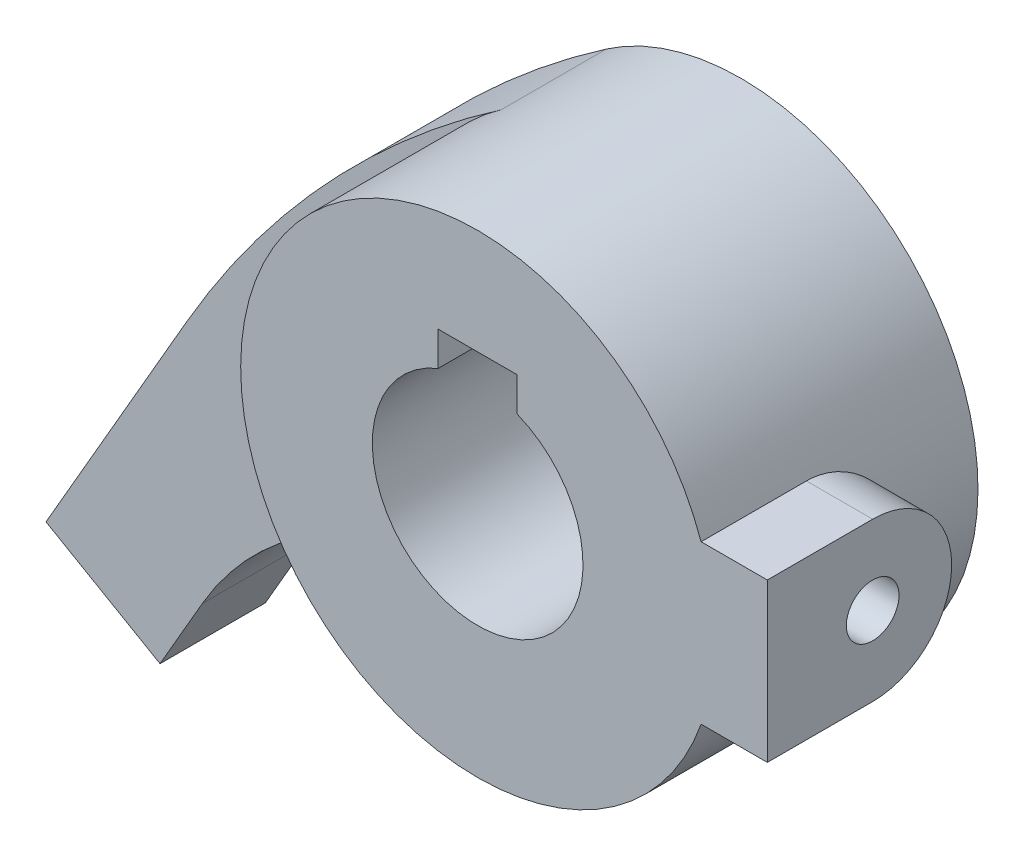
ISO-10303-21;
HEADER;
FILE_DESCRIPTION(('STEP AP214'),'2;1');
FILE_NAME('part.step','',(''),(''),'','','');
FILE_SCHEMA(('AUTOMOTIVE_DESIGN { 1 0 10303 214 1 1 1 1 }'));
ENDSEC;
DATA;
#1=APPLICATION_CONTEXT('core data for automotive mechanical design processes');
#2=APPLICATION_PROTOCOL_DEFINITION('international standard','automotive_design',2000,#1);
#3=PRODUCT_CONTEXT('',#1,'mechanical');
#4=PRODUCT('Part','Part','',(#3));
#5=PRODUCT_RELATED_PRODUCT_CATEGORY('part','',(#4));
#6=PRODUCT_DEFINITION_FORMATION('','',#4);
#7=PRODUCT_DEFINITION_CONTEXT('part definition',#1,'design');
#8=PRODUCT_DEFINITION('design','',#6,#7);
#9=PRODUCT_DEFINITION_SHAPE('','',#8);
#10=(LENGTH_UNIT() NAMED_UNIT(*) SI_UNIT(.MILLI.,.METRE.));
#11=(NAMED_UNIT(*) PLANE_ANGLE_UNIT() SI_UNIT($,.RADIAN.));
#12=(NAMED_UNIT(*) SI_UNIT($,.STERADIAN.) SOLID_ANGLE_UNIT());
#13=UNCERTAINTY_MEASURE_WITH_UNIT(LENGTH_MEASURE(1.E-05),#10,'distance_accuracy_value','');
#14=(GEOMETRIC_REPRESENTATION_CONTEXT(3) GLOBAL_UNCERTAINTY_ASSIGNED_CONTEXT((#13)) GLOBAL_UNIT_ASSIGNED_CONTEXT((#10,
#11,#12)) REPRESENTATION_CONTEXT('',''));
#15=CARTESIAN_POINT('',(0.,0.,0.));
#16=DIRECTION('',(0.,0.,1.));
#17=DIRECTION('',(1.,0.,0.));
#18=AXIS2_PLACEMENT_3D('',#15,#16,#17);
#19=CARTESIAN_POINT('',(0.,0.,20.));
#20=DIRECTION('',(0.,0.,-1.));
#21=DIRECTION('',(-1.,0.,0.));
#22=AXIS2_PLACEMENT_3D('',#19,#20,#21);
#23=CYLINDRICAL_SURFACE('',#22,18.);
#24=CARTESIAN_POINT('',(0.,0.,20.));
#25=DIRECTION('',(0.,0.,1.));
#26=DIRECTION('',(1.,0.,0.));
#27=AXIS2_PLACEMENT_3D('',#24,#25,#26);
#28=CIRCLE('',#27,18.);
#29=CARTESIAN_POINT('',(16.9705627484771,6.,20.));
#30=VERTEX_POINT('',#29);
#31=CARTESIAN_POINT('',(16.9705627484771,-6.,20.));
#32=VERTEX_POINT('',#31);
#33=EDGE_CURVE('E11',#30,#32,#28,.T.);
#34=ORIENTED_EDGE('',*,*,#33,.F.);
#35=DIRECTION('',(0.,0.,-1.));
#36=VECTOR('',#35,1.);
#37=CARTESIAN_POINT('',(16.9705627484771,6.,20.));
#38=LINE('',#37,#36);
#39=CARTESIAN_POINT('',(16.9705627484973,6.,12.));
#40=VERTEX_POINT('',#39);
#41=EDGE_CURVE('E153',#40,#30,#38,.F.);
#42=ORIENTED_EDGE('',*,*,#41,.F.);
#43=CARTESIAN_POINT('',(16.9705627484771,-6.,12.));
#44=CARTESIAN_POINT('',(16.9705358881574,-6.00002327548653,11.8363059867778));
#45=CARTESIAN_POINT('',(16.9729302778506,-5.99330214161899,11.6726221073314));
#46=CARTESIAN_POINT('',(16.9823649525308,-5.96654425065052,11.3465240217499));
#47=CARTESIAN_POINT('',(16.9894039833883,-5.94651108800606,11.1841094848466));
#48=CARTESIAN_POINT('',(17.0079041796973,-5.89338071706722,10.8621857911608));
#49=CARTESIAN_POINT('',(17.0193522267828,-5.86032225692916,10.7026694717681));
#50=CARTESIAN_POINT('',(17.0463054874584,-5.78145443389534,10.3871697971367));
#51=CARTESIAN_POINT('',(17.0618108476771,-5.73564461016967,10.231186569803));
#52=CARTESIAN_POINT('',(17.096396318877,-5.63171582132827,9.92393152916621));
#53=CARTESIAN_POINT('',(17.1154735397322,-5.57360680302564,9.77265602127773));
#54=CARTESIAN_POINT('',(17.1566605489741,-5.44550500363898,9.47558904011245));
#55=CARTESIAN_POINT('',(17.1787714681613,-5.37550778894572,9.32979963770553));
#56=CARTESIAN_POINT('',(17.2254031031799,-5.22415126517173,9.04461346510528));
#57=CARTESIAN_POINT('',(17.2499242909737,-5.14278972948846,8.90521795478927));
#58=CARTESIAN_POINT('',(17.3007173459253,-4.9692408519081,8.63360277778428));
#59=CARTESIAN_POINT('',(17.326989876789,-4.8770493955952,8.50138586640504));
#60=CARTESIAN_POINT('',(17.3815260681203,-4.67904463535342,8.24043953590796));
#61=CARTESIAN_POINT('',(17.4098272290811,-4.57286774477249,8.11199371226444));
#62=CARTESIAN_POINT('',(17.4667935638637,-4.35021031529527,7.86437382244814));
#63=CARTESIAN_POINT('',(17.49545886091,-4.23372620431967,7.74520299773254));
#64=CARTESIAN_POINT('',(17.5523750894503,-3.99119540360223,7.51691026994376));
#65=CARTESIAN_POINT('',(17.5806260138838,-3.86514855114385,7.40778853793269));
#66=CARTESIAN_POINT('',(17.6359611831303,-3.60425478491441,7.20029931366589));
#67=CARTESIAN_POINT('',(17.6630454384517,-3.46940795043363,7.1019317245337));
#68=CARTESIAN_POINT('',(17.716017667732,-3.1880620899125,6.91417565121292));
#69=CARTESIAN_POINT('',(17.7418552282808,-3.04134950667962,6.82509253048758));
#70=CARTESIAN_POINT('',(17.790803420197,-2.74053335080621,6.65968846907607));
#71=CARTESIAN_POINT('',(17.8139150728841,-2.5864325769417,6.58336274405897));
#72=CARTESIAN_POINT('',(17.8567641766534,-2.27182245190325,6.44406426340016));
#73=CARTESIAN_POINT('',(17.8765010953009,-2.11131209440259,6.38109361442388));
#74=CARTESIAN_POINT('',(17.9120119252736,-1.78513959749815,6.26911941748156));
#75=CARTESIAN_POINT('',(17.9277876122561,-1.61947980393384,6.22010961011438));
#76=CARTESIAN_POINT('',(17.9544516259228,-1.28997729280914,6.13793631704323));
#77=CARTESIAN_POINT('',(17.9654893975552,-1.12626807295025,6.10428575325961));
#78=CARTESIAN_POINT('',(17.9831292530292,-0.796442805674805,6.05074979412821));
#79=CARTESIAN_POINT('',(17.9897331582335,-0.630327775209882,6.03085874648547));
#80=CARTESIAN_POINT('',(17.9983239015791,-0.296898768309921,6.00501776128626));
#81=CARTESIAN_POINT('',(18.0003107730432,-0.129584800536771,5.99906772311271));
#82=CARTESIAN_POINT('',(17.999610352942,0.204943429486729,6.00116890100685));
#83=CARTESIAN_POINT('',(17.9969231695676,0.372157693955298,6.00921979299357));
#84=CARTESIAN_POINT('',(17.987149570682,0.698613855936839,6.038646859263));
#85=CARTESIAN_POINT('',(17.9802409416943,0.857909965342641,6.05948465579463));
#86=CARTESIAN_POINT('',(17.9623622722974,1.17415159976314,6.1138198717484));
#87=CARTESIAN_POINT('',(17.9513908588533,1.33109631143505,6.14732157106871));
#88=CARTESIAN_POINT('',(17.9256761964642,1.64145470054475,6.22667565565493));
#89=CARTESIAN_POINT('',(17.9109342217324,1.79486955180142,6.27252386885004));
#90=CARTESIAN_POINT('',(17.8780472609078,2.09727695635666,6.37621207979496));
#91=CARTESIAN_POINT('',(17.8599009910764,2.24626781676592,6.4340566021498));
#92=CARTESIAN_POINT('',(17.8204139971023,2.54070679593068,6.56208597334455));
#93=CARTESIAN_POINT('',(17.7990354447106,2.686085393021,6.632418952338));
#94=CARTESIAN_POINT('',(17.753792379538,2.97045362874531,6.78440731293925));
#95=CARTESIAN_POINT('',(17.7299270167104,3.10944105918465,6.86606656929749));
#96=CARTESIAN_POINT('',(17.6803107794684,3.38017058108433,7.04012638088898));
#97=CARTESIAN_POINT('',(17.6545598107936,3.51191230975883,7.13252747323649));
#98=CARTESIAN_POINT('',(17.601809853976,3.767400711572,7.32747242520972));
#99=CARTESIAN_POINT('',(17.5748108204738,3.89114709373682,7.43001665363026));
#100=CARTESIAN_POINT('',(17.5189422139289,4.13559143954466,7.64969602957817));
#101=CARTESIAN_POINT('',(17.4900445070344,4.2558696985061,7.76729146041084));
#102=CARTESIAN_POINT('',(17.4324086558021,4.4861132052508,8.01214074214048));
#103=CARTESIAN_POINT('',(17.4036704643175,4.59608167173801,8.13939155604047));
#104=CARTESIAN_POINT('',(17.3471202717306,4.8051173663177,8.40289722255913));
#105=CARTESIAN_POINT('',(17.3193089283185,4.90417696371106,8.53915827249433));
#106=CARTESIAN_POINT('',(17.2654357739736,5.09059336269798,8.81971485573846));
#107=CARTESIAN_POINT('',(17.239373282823,5.17795472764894,8.96400722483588));
#108=CARTESIAN_POINT('',(17.1893738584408,5.34161618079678,9.26203101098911));
#109=CARTESIAN_POINT('',(17.1654753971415,5.41772728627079,9.41587280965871));
#110=CARTESIAN_POINT('',(17.1210224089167,5.556609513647,9.72985774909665));
#111=CARTESIAN_POINT('',(17.1004664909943,5.61938618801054,9.88999823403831));
#112=CARTESIAN_POINT('',(17.0633817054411,5.73100924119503,10.2153228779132));
#113=CARTESIAN_POINT('',(17.0468484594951,5.77987077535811,10.3805013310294));
#114=CARTESIAN_POINT('',(17.0183470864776,5.86325820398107,10.7147529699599));
#115=CARTESIAN_POINT('',(17.0063768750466,5.89779064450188,10.883824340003));
#116=CARTESIAN_POINT('',(16.9882040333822,5.94992929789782,11.2104634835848));
#117=CARTESIAN_POINT('',(16.9816058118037,5.96870055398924,11.3678241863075));
#118=CARTESIAN_POINT('',(16.9727764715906,5.99373749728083,11.6834525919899));
#119=CARTESIAN_POINT('',(16.9705397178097,6.00001932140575,11.8417188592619));
#120=CARTESIAN_POINT('',(16.9705627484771,6.,12.));
#121=B_SPLINE_CURVE_WITH_KNOTS('',3,(#43,#44,#45,#46,#47,#48,#49,#50,#51,#52,#53,#54,#55,#56,
#57,#58,#59,#60,#61,#62,#63,#64,#65,#66,#67,#68,#69,#70,#71,#72,#73,#74,#75,#76,#77,#78,#79,#80,
#81,#82,#83,#84,#85,#86,#87,#88,#89,#90,#91,#92,#93,#94,#95,#96,#97,#98,#99,#100,#101,#102,#103,
#104,#105,#106,#107,#108,#109,#110,#111,#112,#113,#114,#115,#116,#117,#118,#119,#120),
.UNSPECIFIED.,.F.,.F.,(4,2,2,2,2,2,2,2,2,2,2,2,2,2,2,2,2,2,2,2,2,2,2,2,2,2,2,2,2,2,2,2,2,2,2,2,
2,2,4),(0.,0.490910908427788,0.9816893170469,1.47101863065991,1.96036563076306,2.44931837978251,
2.93845388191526,3.42768535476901,3.91710329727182,4.42363425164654,4.93034144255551,
5.43705725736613,5.94376850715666,6.46384823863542,6.98373248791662,7.50369868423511,
8.02343138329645,8.52528690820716,9.02693615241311,9.52858177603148,10.0302157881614,
10.5120543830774,10.9940559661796,11.4758948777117,11.9579158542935,12.4460912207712,
12.9344340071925,13.4228012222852,13.9111862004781,14.4226273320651,14.9339082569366,
15.445544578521,15.9569807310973,16.4762155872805,16.9952338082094,17.5136845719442,
18.0318982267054,18.5071898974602,18.9818670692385),.UNSPECIFIED.);
#122=CARTESIAN_POINT('',(16.9705627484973,-6.,12.));
#123=VERTEX_POINT('',#122);
#124=EDGE_CURVE('E151',#123,#40,#121,.T.);
#125=ORIENTED_EDGE('',*,*,#124,.F.);
#126=DIRECTION('',(0.,0.,-1.));
#127=VECTOR('',#126,1.);
#128=CARTESIAN_POINT('',(16.9705627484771,-6.,20.));
#129=LINE('',#128,#127);
#130=EDGE_CURVE('E159',#32,#123,#129,.T.);
#131=ORIENTED_EDGE('',*,*,#130,.F.);
#132=EDGE_LOOP('',(#34,#42,#125,#131));
#133=FACE_BOUND('',#132,.T.);
#134=DIRECTION('',(0.,0.,-1.));
#135=VECTOR('',#134,1.);
#136=CARTESIAN_POINT('',(-10.2174061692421,14.819062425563,8.));
#137=LINE('',#136,#135);
#138=CARTESIAN_POINT('',(-10.2174061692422,14.819062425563,8.));
#139=VERTEX_POINT('',#138);
#140=CARTESIAN_POINT('',(-10.2174061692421,14.819062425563,0.));
#141=VERTEX_POINT('',#140);
#142=EDGE_CURVE('E50',#139,#141,#137,.T.);
#143=ORIENTED_EDGE('',*,*,#142,.F.);
#144=CARTESIAN_POINT('',(0.,0.,8.));
#145=DIRECTION('',(0.,0.,-1.));
#146=DIRECTION('',(1.,0.,0.));
#147=AXIS2_PLACEMENT_3D('',#144,#145,#146);
#148=CIRCLE('',#147,18.);
#149=CARTESIAN_POINT('',(-4.7127894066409,-17.3720930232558,8.));
#150=VERTEX_POINT('',#149);
#151=EDGE_CURVE('E45',#150,#139,#148,.T.);
#152=ORIENTED_EDGE('',*,*,#151,.F.);
#153=DIRECTION('',(0.,0.,-1.));
#154=VECTOR('',#153,1.);
#155=CARTESIAN_POINT('',(-4.7127894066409,-17.3720930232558,8.));
#156=LINE('',#155,#154);
#157=CARTESIAN_POINT('',(-4.7127894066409,-17.3720930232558,0.));
#158=VERTEX_POINT('',#157);
#159=EDGE_CURVE('E254',#150,#158,#156,.T.);
#160=ORIENTED_EDGE('',*,*,#159,.T.);
#161=CARTESIAN_POINT('',(0.,0.,0.));
#162=DIRECTION('',(0.,0.,1.));
#163=DIRECTION('',(1.,0.,0.));
#164=AXIS2_PLACEMENT_3D('',#161,#162,#163);
#165=CIRCLE('',#164,18.);
#166=EDGE_CURVE('E34',#158,#141,#165,.T.);
#167=ORIENTED_EDGE('',*,*,#166,.T.);
#168=EDGE_LOOP('',(#143,#152,#160,#167));
#169=FACE_BOUND('',#168,.T.);
#170=ADVANCED_FACE('F31',(#133,#169),#23,.T.);
#171=CARTESIAN_POINT('',(0.,0.,20.));
#172=DIRECTION('',(0.,0.,1.));
#173=DIRECTION('',(1.,0.,0.));
#174=AXIS2_PLACEMENT_3D('',#171,#172,#173);
#175=PLANE('',#174);
#176=ORIENTED_EDGE('',*,*,#33,.T.);
#177=DIRECTION('',(1.,0.,0.));
#178=VECTOR('',#177,1.);
#179=CARTESIAN_POINT('',(-500000.,-6.,20.));
#180=LINE('',#179,#178);
#181=CARTESIAN_POINT('',(22.,-6.,20.));
#182=VERTEX_POINT('',#181);
#183=EDGE_CURVE('E206',#32,#182,#180,.T.);
#184=ORIENTED_EDGE('',*,*,#183,.T.);
#185=DIRECTION('',(0.,-1.,0.));
#186=VECTOR('',#185,1.);
#187=CARTESIAN_POINT('',(22.,6.,20.));
#188=LINE('',#187,#186);
#189=CARTESIAN_POINT('',(22.,6.,20.));
#190=VERTEX_POINT('',#189);
#191=EDGE_CURVE('E210',#190,#182,#188,.T.);
#192=ORIENTED_EDGE('',*,*,#191,.F.);
#193=DIRECTION('',(1.,0.,0.));
#194=VECTOR('',#193,1.);
#195=CARTESIAN_POINT('',(-500000.,6.,20.));
#196=LINE('',#195,#194);
#197=EDGE_CURVE('E208',#30,#190,#196,.T.);
#198=ORIENTED_EDGE('',*,*,#197,.F.);
#199=EDGE_LOOP('',(#176,#184,#192,#198));
#200=FACE_BOUND('',#199,.T.);
#201=DIRECTION('',(0.,1.,0.));
#202=VECTOR('',#201,1.);
#203=CARTESIAN_POINT('',(3.,7.41619848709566,20.));
#204=LINE('',#203,#202);
#205=CARTESIAN_POINT('',(3.,7.41619848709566,20.));
#206=VERTEX_POINT('',#205);
#207=CARTESIAN_POINT('',(3.,10.,20.));
#208=VERTEX_POINT('',#207);
#209=EDGE_CURVE('E222',#206,#208,#204,.T.);
#210=ORIENTED_EDGE('',*,*,#209,.F.);
#211=CARTESIAN_POINT('',(0.,0.,20.));
#212=DIRECTION('',(0.,0.,1.));
#213=DIRECTION('',(1.,0.,0.));
#214=AXIS2_PLACEMENT_3D('',#211,#212,#213);
#215=CIRCLE('',#214,8.);
#216=CARTESIAN_POINT('',(-3.,7.41619848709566,20.));
#217=VERTEX_POINT('',#216);
#218=EDGE_CURVE('E220',#217,#206,#215,.T.);
#219=ORIENTED_EDGE('',*,*,#218,.F.);
#220=DIRECTION('',(0.,-1.,0.));
#221=VECTOR('',#220,1.);
#222=CARTESIAN_POINT('',(-3.,7.41619848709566,20.));
#223=LINE('',#222,#221);
#224=CARTESIAN_POINT('',(-3.,10.,20.));
#225=VERTEX_POINT('',#224);
#226=EDGE_CURVE('E228',#225,#217,#223,.T.);
#227=ORIENTED_EDGE('',*,*,#226,.F.);
#228=DIRECTION('',(-1.,0.,0.));
#229=VECTOR('',#228,1.);
#230=CARTESIAN_POINT('',(-3.,10.,20.));
#231=LINE('',#230,#229);
#232=EDGE_CURVE('E225',#208,#225,#231,.T.);
#233=ORIENTED_EDGE('',*,*,#232,.F.);
#234=EDGE_LOOP('',(#210,#219,#227,#233));
#235=FACE_BOUND('',#234,.T.);
#236=ADVANCED_FACE('F191',(#200,#235),#175,.T.);
#237=CARTESIAN_POINT('',(0.,0.,0.));
#238=DIRECTION('',(0.,0.,1.));
#239=DIRECTION('',(1.,0.,0.));
#240=AXIS2_PLACEMENT_3D('',#237,#238,#239);
#241=PLANE('',#240);
#242=ORIENTED_EDGE('',*,*,#166,.F.);
#243=CARTESIAN_POINT('',(-11.2583302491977,-41.5,0.));
#244=DIRECTION('',(0.,0.,-1.));
#245=DIRECTION('',(1.,0.,0.));
#246=AXIS2_PLACEMENT_3D('',#243,#244,#245);
#247=CIRCLE('',#246,25.);
#248=CARTESIAN_POINT('',(-32.9089653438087,-29.,0.));
#249=VERTEX_POINT('',#248);
#250=EDGE_CURVE('E146',#249,#158,#247,.T.);
#251=ORIENTED_EDGE('',*,*,#250,.F.);
#252=DIRECTION('',(0.499999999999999,0.866025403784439,0.));
#253=VECTOR('',#252,1.);
#254=CARTESIAN_POINT('',(-32.9089653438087,-29.,0.));
#255=LINE('',#254,#253);
#256=CARTESIAN_POINT('',(-36.1243556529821,-34.5692193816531,0.));
#257=VERTEX_POINT('',#256);
#258=EDGE_CURVE('E273',#257,#249,#255,.T.);
#259=ORIENTED_EDGE('',*,*,#258,.F.);
#260=DIRECTION('',(0.866025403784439,-0.499999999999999,0.));
#261=VECTOR('',#260,1.);
#262=CARTESIAN_POINT('',(-44.7846096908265,-29.5692193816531,0.));
#263=LINE('',#262,#261);
#264=CARTESIAN_POINT('',(-44.7846096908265,-29.5692193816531,0.));
#265=VERTEX_POINT('',#264);
#266=EDGE_CURVE('E264',#265,#257,#263,.T.);
#267=ORIENTED_EDGE('',*,*,#266,.F.);
#268=DIRECTION('',(-0.5,-0.866025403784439,0.));
#269=VECTOR('',#268,1.);
#270=CARTESIAN_POINT('',(-34.0887443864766,-11.0434372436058,0.));
#271=LINE('',#270,#269);
#272=CARTESIAN_POINT('',(-34.0887443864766,-11.0434372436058,0.));
#273=VERTEX_POINT('',#272);
#274=EDGE_CURVE('E261',#273,#265,#271,.T.);
#275=ORIENTED_EDGE('',*,*,#274,.F.);
#276=CARTESIAN_POINT('',(35.1932879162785,-51.0434372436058,0.));
#277=DIRECTION('',(0.,0.,1.));
#278=DIRECTION('',(1.,0.,0.));
#279=AXIS2_PLACEMENT_3D('',#276,#277,#278);
#280=CIRCLE('',#279,80.);
#281=EDGE_CURVE('E150',#141,#273,#280,.T.);
#282=ORIENTED_EDGE('',*,*,#281,.F.);
#283=EDGE_LOOP('',(#242,#251,#259,#267,#275,#282));
#284=FACE_BOUND('',#283,.T.);
#285=CARTESIAN_POINT('',(0.,0.,0.));
#286=DIRECTION('',(0.,0.,1.));
#287=DIRECTION('',(1.,0.,0.));
#288=AXIS2_PLACEMENT_3D('',#285,#286,#287);
#289=CIRCLE('',#288,8.);
#290=CARTESIAN_POINT('',(-3.,7.41619848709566,0.));
#291=VERTEX_POINT('',#290);
#292=CARTESIAN_POINT('',(3.,7.41619848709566,0.));
#293=VERTEX_POINT('',#292);
#294=EDGE_CURVE('E231',#291,#293,#289,.T.);
#295=ORIENTED_EDGE('',*,*,#294,.T.);
#296=DIRECTION('',(0.,1.,0.));
#297=VECTOR('',#296,1.);
#298=CARTESIAN_POINT('',(3.,7.41619848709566,0.));
#299=LINE('',#298,#297);
#300=CARTESIAN_POINT('',(3.,10.,0.));
#301=VERTEX_POINT('',#300);
#302=EDGE_CURVE('E234',#293,#301,#299,.T.);
#303=ORIENTED_EDGE('',*,*,#302,.T.);
#304=DIRECTION('',(-1.,0.,0.));
#305=VECTOR('',#304,1.);
#306=CARTESIAN_POINT('',(-3.,10.,0.));
#307=LINE('',#306,#305);
#308=CARTESIAN_POINT('',(-3.,10.,0.));
#309=VERTEX_POINT('',#308);
#310=EDGE_CURVE('E238',#301,#309,#307,.T.);
#311=ORIENTED_EDGE('',*,*,#310,.T.);
#312=DIRECTION('',(0.,-1.,0.));
#313=VECTOR('',#312,1.);
#314=CARTESIAN_POINT('',(-3.,7.41619848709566,0.));
#315=LINE('',#314,#313);
#316=EDGE_CURVE('E223',#309,#291,#315,.T.);
#317=ORIENTED_EDGE('',*,*,#316,.T.);
#318=EDGE_LOOP('',(#295,#303,#311,#317));
#319=FACE_BOUND('',#318,.T.);
#320=ADVANCED_FACE('F196',(#284,#319),#241,.F.);
#321=CARTESIAN_POINT('',(0.,0.,20.));
#322=DIRECTION('',(0.,0.,-1.));
#323=DIRECTION('',(-1.,0.,0.));
#324=AXIS2_PLACEMENT_3D('',#321,#322,#323);
#325=CYLINDRICAL_SURFACE('',#324,8.);
#326=CARTESIAN_POINT('',(8.,0.,10.));
#327=CARTESIAN_POINT('',(7.9999981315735,-0.110501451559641,10.0000031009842));
#328=CARTESIAN_POINT('',(7.99768770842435,-0.221037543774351,10.0091887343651));
#329=CARTESIAN_POINT('',(7.98869485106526,-0.438941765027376,10.045633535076));
#330=CARTESIAN_POINT('',(7.98200993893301,-0.546308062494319,10.0729029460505));
#331=CARTESIAN_POINT('',(7.96500835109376,-0.754694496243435,10.1445856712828));
#332=CARTESIAN_POINT('',(7.95469603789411,-0.855722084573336,10.188978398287));
#333=CARTESIAN_POINT('',(7.93153791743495,-1.04889617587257,10.2935751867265));
#334=CARTESIAN_POINT('',(7.91869202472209,-1.14104237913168,10.353779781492));
#335=CARTESIAN_POINT('',(7.89156551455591,-1.31573590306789,10.4896010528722));
#336=CARTESIAN_POINT('',(7.87726276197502,-1.39807425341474,10.5654820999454));
#337=CARTESIAN_POINT('',(7.84898160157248,-1.54899856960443,10.729936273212));
#338=CARTESIAN_POINT('',(7.83500323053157,-1.61758298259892,10.8185108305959));
#339=CARTESIAN_POINT('',(7.80873034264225,-1.74003539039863,11.007460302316));
#340=CARTESIAN_POINT('',(7.79646392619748,-1.79366962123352,11.1079909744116));
#341=CARTESIAN_POINT('',(7.77532659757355,-1.88319587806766,11.3169978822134));
#342=CARTESIAN_POINT('',(7.76645514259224,-1.91909074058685,11.4254728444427));
#343=CARTESIAN_POINT('',(7.7533396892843,-1.97140644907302,11.6449913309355));
#344=CARTESIAN_POINT('',(7.74900654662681,-1.98820302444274,11.755939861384));
#345=CARTESIAN_POINT('',(7.74519149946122,-2.00301570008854,11.9791580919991));
#346=CARTESIAN_POINT('',(7.74570880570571,-2.00103485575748,12.0914275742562));
#347=CARTESIAN_POINT('',(7.75145607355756,-1.97864869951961,12.3112210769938));
#348=CARTESIAN_POINT('',(7.75657150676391,-1.95869112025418,12.4187941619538));
#349=CARTESIAN_POINT('',(7.77075612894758,-1.90163224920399,12.6290147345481));
#350=CARTESIAN_POINT('',(7.77982559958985,-1.86452973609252,12.7316618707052));
#351=CARTESIAN_POINT('',(7.80100151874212,-1.77385263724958,12.9303173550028));
#352=CARTESIAN_POINT('',(7.81313769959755,-1.72011555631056,13.0262482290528));
#353=CARTESIAN_POINT('',(7.83906281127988,-1.59780836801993,13.2078916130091));
#354=CARTESIAN_POINT('',(7.85285203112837,-1.52923566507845,13.2936023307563));
#355=CARTESIAN_POINT('',(7.88101174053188,-1.37688456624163,13.4549381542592));
#356=CARTESIAN_POINT('',(7.89538759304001,-1.29272834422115,13.5302059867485));
#357=CARTESIAN_POINT('',(7.92274620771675,-1.11281589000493,13.6656283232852));
#358=CARTESIAN_POINT('',(7.93572892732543,-1.01705930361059,13.7257823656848));
#359=CARTESIAN_POINT('',(7.9589030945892,-0.816154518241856,13.8294007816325));
#360=CARTESIAN_POINT('',(7.96908480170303,-0.710975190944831,13.8728071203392));
#361=CARTESIAN_POINT('',(7.98543889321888,-0.49450134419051,13.9412230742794));
#362=CARTESIAN_POINT('',(7.99161204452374,-0.383207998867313,13.9662362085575));
#363=CARTESIAN_POINT('',(7.999139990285,-0.160719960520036,13.9966100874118));
#364=CARTESIAN_POINT('',(8.00061404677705,-0.0495956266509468,14.0024573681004));
#365=CARTESIAN_POINT('',(7.99891739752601,0.172043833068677,13.9956679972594));
#366=CARTESIAN_POINT('',(7.99574710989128,0.282559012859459,13.9830330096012));
#367=CARTESIAN_POINT('',(7.98519441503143,0.498152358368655,13.9400387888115));
#368=CARTESIAN_POINT('',(7.97787512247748,0.603286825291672,13.9099449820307));
#369=CARTESIAN_POINT('',(7.95984942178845,0.807009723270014,13.8331905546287));
#370=CARTESIAN_POINT('',(7.94914267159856,0.905597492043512,13.7865282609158));
#371=CARTESIAN_POINT('',(7.92524410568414,1.0953641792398,13.6770184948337));
#372=CARTESIAN_POINT('',(7.91201156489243,1.18638058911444,13.6138985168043));
#373=CARTESIAN_POINT('',(7.88459345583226,1.35670215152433,13.4736134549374));
#374=CARTESIAN_POINT('',(7.87040772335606,1.43600527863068,13.3964459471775));
#375=CARTESIAN_POINT('',(7.84225275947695,1.58265409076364,13.2279973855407));
#376=CARTESIAN_POINT('',(7.82829738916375,1.64965849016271,13.1364163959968));
#377=CARTESIAN_POINT('',(7.80257171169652,1.7673476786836,12.9430231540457));
#378=CARTESIAN_POINT('',(7.79080130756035,1.81803319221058,12.8412113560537));
#379=CARTESIAN_POINT('',(7.77090792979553,1.90126856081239,12.6307923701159));
#380=CARTESIAN_POINT('',(7.76276340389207,1.93392586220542,12.5222298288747));
#381=CARTESIAN_POINT('',(7.75102325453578,1.98046087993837,12.3009204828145));
#382=CARTESIAN_POINT('',(7.74742663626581,1.99434270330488,12.1881745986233));
#383=CARTESIAN_POINT('',(7.74526534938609,2.00271812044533,11.9651719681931));
#384=CARTESIAN_POINT('',(7.74655910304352,1.99775719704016,11.854936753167));
#385=CARTESIAN_POINT('',(7.7537054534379,1.96983637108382,11.6369281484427));
#386=CARTESIAN_POINT('',(7.75955795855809,1.94687683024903,11.5291547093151));
#387=CARTESIAN_POINT('',(7.77508347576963,1.88390842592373,11.3197220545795));
#388=CARTESIAN_POINT('',(7.78473353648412,1.84400187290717,11.2180302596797));
#389=CARTESIAN_POINT('',(7.80677007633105,1.74835321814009,11.0227128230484));
#390=CARTESIAN_POINT('',(7.81915693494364,1.69260892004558,10.9290883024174));
#391=CARTESIAN_POINT('',(7.84567512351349,1.56515699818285,10.7499271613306));
#392=CARTESIAN_POINT('',(7.85984353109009,1.49307088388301,10.6646652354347));
#393=CARTESIAN_POINT('',(7.88810702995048,1.33571916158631,10.5072706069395));
#394=CARTESIAN_POINT('',(7.90220210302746,1.25045042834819,10.435141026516));
#395=CARTESIAN_POINT('',(7.92903540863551,1.06729011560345,10.3047849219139));
#396=CARTESIAN_POINT('',(7.94174444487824,0.969197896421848,10.2468338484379));
#397=CARTESIAN_POINT('',(7.96406566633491,0.764354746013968,10.1483367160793));
#398=CARTESIAN_POINT('',(7.97368006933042,0.657610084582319,10.107778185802));
#399=CARTESIAN_POINT('',(7.98730746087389,0.459213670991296,10.0512375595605));
#400=CARTESIAN_POINT('',(7.9920344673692,0.368506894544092,10.0320650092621));
#401=CARTESIAN_POINT('',(7.99838140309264,0.185208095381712,10.0064454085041));
#402=CARTESIAN_POINT('',(8.00000156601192,0.0926162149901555,9.99999740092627));
#403=CARTESIAN_POINT('',(8.,0.,10.));
#404=B_SPLINE_CURVE_WITH_KNOTS('',3,(#326,#327,#328,#329,#330,#331,#332,#333,#334,#335,#336,
#337,#338,#339,#340,#341,#342,#343,#344,#345,#346,#347,#348,#349,#350,#351,#352,#353,#354,#355,
#356,#357,#358,#359,#360,#361,#362,#363,#364,#365,#366,#367,#368,#369,#370,#371,#372,#373,#374,
#375,#376,#377,#378,#379,#380,#381,#382,#383,#384,#385,#386,#387,#388,#389,#390,#391,#392,#393,
#394,#395,#396,#397,#398,#399,#400,#401,#402,#403),.UNSPECIFIED.,.T.,.F.,(4,2,2,2,2,2,2,2,2,2,2,
2,2,2,2,2,2,2,2,2,2,2,2,2,2,2,2,2,2,2,2,2,2,2,2,2,2,2,4),(0.,0.331164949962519,
0.662517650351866,0.993473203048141,1.32443992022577,1.66152580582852,1.99864972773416,
2.34078196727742,2.68285948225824,3.01808393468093,3.3532538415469,3.68029996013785,
4.00736937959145,4.337740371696,4.66816921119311,5.00802001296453,5.34788119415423,
5.68890972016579,6.02987298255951,6.36211078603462,6.69431868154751,7.02160366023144,
7.34892169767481,7.68204783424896,8.01523150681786,8.35659345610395,8.69794025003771,
9.03723006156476,9.37644564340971,9.70591707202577,10.0353818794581,10.3628853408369,
10.6904342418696,11.0265276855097,11.3627009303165,11.7049624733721,12.0469781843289,
12.3245632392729,12.6021274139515),.UNSPECIFIED.);
#405=CARTESIAN_POINT('',(8.,0.,10.));
#406=VERTEX_POINT('',#405);
#407=EDGE_CURVE('E262',#406,#406,#404,.T.);
#408=ORIENTED_EDGE('',*,*,#407,.F.);
#409=EDGE_LOOP('',(#408));
#410=FACE_BOUND('',#409,.T.);
#411=ORIENTED_EDGE('',*,*,#294,.F.);
#412=DIRECTION('',(0.,0.,-1.));
#413=VECTOR('',#412,1.);
#414=CARTESIAN_POINT('',(-3.,7.41619848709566,20.));
#415=LINE('',#414,#413);
#416=EDGE_CURVE('E230',#217,#291,#415,.T.);
#417=ORIENTED_EDGE('',*,*,#416,.F.);
#418=ORIENTED_EDGE('',*,*,#218,.T.);
#419=DIRECTION('',(0.,0.,-1.));
#420=VECTOR('',#419,1.);
#421=CARTESIAN_POINT('',(3.,7.41619848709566,20.));
#422=LINE('',#421,#420);
#423=EDGE_CURVE('E249',#206,#293,#422,.T.);
#424=ORIENTED_EDGE('',*,*,#423,.T.);
#425=EDGE_LOOP('',(#411,#417,#418,#424));
#426=FACE_BOUND('',#425,.T.);
#427=ADVANCED_FACE('F299',(#410,#426),#325,.F.);
#428=CARTESIAN_POINT('',(3.,7.41619848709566,20.));
#429=DIRECTION('',(-1.,0.,0.));
#430=DIRECTION('',(0.,0.,1.));
#431=AXIS2_PLACEMENT_3D('',#428,#429,#430);
#432=PLANE('',#431);
#433=ORIENTED_EDGE('',*,*,#302,.F.);
#434=ORIENTED_EDGE('',*,*,#423,.F.);
#435=ORIENTED_EDGE('',*,*,#209,.T.);
#436=DIRECTION('',(0.,0.,-1.));
#437=VECTOR('',#436,1.);
#438=CARTESIAN_POINT('',(3.,10.,20.));
#439=LINE('',#438,#437);
#440=EDGE_CURVE('E247',#208,#301,#439,.T.);
#441=ORIENTED_EDGE('',*,*,#440,.T.);
#442=EDGE_LOOP('',(#433,#434,#435,#441));
#443=FACE_BOUND('',#442,.T.);
#444=ADVANCED_FACE('F359',(#443),#432,.T.);
#445=CARTESIAN_POINT('',(-3.,10.,20.));
#446=DIRECTION('',(0.,-1.,0.));
#447=DIRECTION('',(0.,0.,-1.));
#448=AXIS2_PLACEMENT_3D('',#445,#446,#447);
#449=PLANE('',#448);
#450=ORIENTED_EDGE('',*,*,#310,.F.);
#451=ORIENTED_EDGE('',*,*,#440,.F.);
#452=ORIENTED_EDGE('',*,*,#232,.T.);
#453=DIRECTION('',(0.,0.,-1.));
#454=VECTOR('',#453,1.);
#455=CARTESIAN_POINT('',(-3.,10.,20.));
#456=LINE('',#455,#454);
#457=EDGE_CURVE('E245',#225,#309,#456,.T.);
#458=ORIENTED_EDGE('',*,*,#457,.T.);
#459=EDGE_LOOP('',(#450,#451,#452,#458));
#460=FACE_BOUND('',#459,.T.);
#461=ADVANCED_FACE('F184',(#460),#449,.T.);
#462=CARTESIAN_POINT('',(-3.,7.41619848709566,20.));
#463=DIRECTION('',(1.,0.,0.));
#464=DIRECTION('',(0.,1.,0.));
#465=AXIS2_PLACEMENT_3D('',#462,#463,#464);
#466=PLANE('',#465);
#467=ORIENTED_EDGE('',*,*,#316,.F.);
#468=ORIENTED_EDGE('',*,*,#457,.F.);
#469=ORIENTED_EDGE('',*,*,#226,.T.);
#470=ORIENTED_EDGE('',*,*,#416,.T.);
#471=EDGE_LOOP('',(#467,#468,#469,#470));
#472=FACE_BOUND('',#471,.T.);
#473=ADVANCED_FACE('F177',(#472),#466,.T.);
#474=CARTESIAN_POINT('',(-500000.,6.,12.));
#475=DIRECTION('',(0.,1.,0.));
#476=DIRECTION('',(0.,0.,1.));
#477=AXIS2_PLACEMENT_3D('',#474,#475,#476);
#478=PLANE('',#477);
#479=DIRECTION('',(1.,0.,0.));
#480=VECTOR('',#479,1.);
#481=CARTESIAN_POINT('',(-500000.,6.,12.));
#482=LINE('',#481,#480);
#483=CARTESIAN_POINT('',(22.,6.,12.));
#484=VERTEX_POINT('',#483);
#485=EDGE_CURVE('E213',#40,#484,#482,.T.);
#486=ORIENTED_EDGE('',*,*,#485,.F.);
#487=ORIENTED_EDGE('',*,*,#41,.T.);
#488=ORIENTED_EDGE('',*,*,#197,.T.);
#489=DIRECTION('',(0.,0.,1.));
#490=VECTOR('',#489,1.);
#491=CARTESIAN_POINT('',(22.,6.,12.));
#492=LINE('',#491,#490);
#493=EDGE_CURVE('E442',#484,#190,#492,.T.);
#494=ORIENTED_EDGE('',*,*,#493,.F.);
#495=EDGE_LOOP('',(#486,#487,#488,#494));
#496=FACE_BOUND('',#495,.T.);
#497=ADVANCED_FACE('F175',(#496),#478,.T.);
#498=CARTESIAN_POINT('',(22.,0.,12.));
#499=DIRECTION('',(1.,0.,0.));
#500=DIRECTION('',(0.,0.,-1.));
#501=AXIS2_PLACEMENT_3D('',#498,#499,#500);
#502=PLANE('',#501);
#503=CARTESIAN_POINT('',(22.,0.,12.));
#504=DIRECTION('',(1.,0.,0.));
#505=DIRECTION('',(0.,0.,-1.));
#506=AXIS2_PLACEMENT_3D('',#503,#504,#505);
#507=CIRCLE('',#506,2.);
#508=CARTESIAN_POINT('',(22.,0.,10.));
#509=VERTEX_POINT('',#508);
#510=EDGE_CURVE('E267',#509,#509,#507,.T.);
#511=ORIENTED_EDGE('',*,*,#510,.F.);
#512=EDGE_LOOP('',(#511));
#513=FACE_BOUND('',#512,.T.);
#514=CARTESIAN_POINT('',(22.,0.,12.));
#515=DIRECTION('',(1.,0.,0.));
#516=DIRECTION('',(0.,0.,-1.));
#517=AXIS2_PLACEMENT_3D('',#514,#515,#516);
#518=CIRCLE('',#517,6.);
#519=CARTESIAN_POINT('',(22.,-6.,12.));
#520=VERTEX_POINT('',#519);
#521=EDGE_CURVE('E235',#520,#484,#518,.T.);
#522=ORIENTED_EDGE('',*,*,#521,.T.);
#523=ORIENTED_EDGE('',*,*,#493,.T.);
#524=ORIENTED_EDGE('',*,*,#191,.T.);
#525=DIRECTION('',(0.,0.,-1.));
#526=VECTOR('',#525,1.);
#527=CARTESIAN_POINT('',(22.,-6.,12.));
#528=LINE('',#527,#526);
#529=EDGE_CURVE('E438',#182,#520,#528,.T.);
#530=ORIENTED_EDGE('',*,*,#529,.T.);
#531=EDGE_LOOP('',(#522,#523,#524,#530));
#532=FACE_BOUND('',#531,.T.);
#533=ADVANCED_FACE('F173',(#513,#532),#502,.T.);
#534=CARTESIAN_POINT('',(-500000.,0.,12.));
#535=DIRECTION('',(1.,0.,0.));
#536=DIRECTION('',(0.,0.,-1.));
#537=AXIS2_PLACEMENT_3D('',#534,#535,#536);
#538=CYLINDRICAL_SURFACE('',#537,6.);
#539=DIRECTION('',(1.,0.,0.));
#540=VECTOR('',#539,1.);
#541=CARTESIAN_POINT('',(-500000.,-6.,12.));
#542=LINE('',#541,#540);
#543=EDGE_CURVE('E215',#123,#520,#542,.T.);
#544=ORIENTED_EDGE('',*,*,#543,.F.);
#545=ORIENTED_EDGE('',*,*,#124,.T.);
#546=ORIENTED_EDGE('',*,*,#485,.T.);
#547=ORIENTED_EDGE('',*,*,#521,.F.);
#548=EDGE_LOOP('',(#544,#545,#546,#547));
#549=FACE_BOUND('',#548,.T.);
#550=ADVANCED_FACE('F167',(#549),#538,.T.);
#551=CARTESIAN_POINT('',(-500000.,-6.,12.));
#552=DIRECTION('',(0.,-1.,0.));
#553=DIRECTION('',(0.,0.,-1.));
#554=AXIS2_PLACEMENT_3D('',#551,#552,#553);
#555=PLANE('',#554);
#556=ORIENTED_EDGE('',*,*,#183,.F.);
#557=ORIENTED_EDGE('',*,*,#130,.T.);
#558=ORIENTED_EDGE('',*,*,#543,.T.);
#559=ORIENTED_EDGE('',*,*,#529,.F.);
#560=EDGE_LOOP('',(#556,#557,#558,#559));
#561=FACE_BOUND('',#560,.T.);
#562=ADVANCED_FACE('F187',(#561),#555,.T.);
#563=CARTESIAN_POINT('',(35.1932879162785,-51.0434372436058,8.));
#564=DIRECTION('',(0.,0.,-1.));
#565=DIRECTION('',(-1.,0.,0.));
#566=AXIS2_PLACEMENT_3D('',#563,#564,#565);
#567=CYLINDRICAL_SURFACE('',#566,80.);
#568=ORIENTED_EDGE('',*,*,#281,.T.);
#569=DIRECTION('',(0.,0.,-1.));
#570=VECTOR('',#569,1.);
#571=CARTESIAN_POINT('',(-34.0887443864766,-11.0434372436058,8.));
#572=LINE('',#571,#570);
#573=CARTESIAN_POINT('',(-34.0887443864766,-11.0434372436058,8.));
#574=VERTEX_POINT('',#573);
#575=EDGE_CURVE('E134',#574,#273,#572,.T.);
#576=ORIENTED_EDGE('',*,*,#575,.F.);
#577=CARTESIAN_POINT('',(35.1932879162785,-51.0434372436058,8.));
#578=DIRECTION('',(0.,0.,1.));
#579=DIRECTION('',(1.,0.,0.));
#580=AXIS2_PLACEMENT_3D('',#577,#578,#579);
#581=CIRCLE('',#580,80.);
#582=EDGE_CURVE('E141',#139,#574,#581,.T.);
#583=ORIENTED_EDGE('',*,*,#582,.F.);
#584=ORIENTED_EDGE('',*,*,#142,.T.);
#585=EDGE_LOOP('',(#568,#576,#583,#584));
#586=FACE_BOUND('',#585,.T.);
#587=ADVANCED_FACE('F148',(#586),#567,.T.);
#588=CARTESIAN_POINT('',(-34.0887443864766,-11.0434372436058,8.));
#589=DIRECTION('',(0.866025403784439,-0.5,0.));
#590=DIRECTION('',(0.5,0.866025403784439,0.));
#591=AXIS2_PLACEMENT_3D('',#588,#589,#590);
#592=PLANE('',#591);
#593=ORIENTED_EDGE('',*,*,#274,.T.);
#594=DIRECTION('',(0.,0.,-1.));
#595=VECTOR('',#594,1.);
#596=CARTESIAN_POINT('',(-44.7846096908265,-29.5692193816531,8.));
#597=LINE('',#596,#595);
#598=CARTESIAN_POINT('',(-44.7846096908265,-29.5692193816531,8.));
#599=VERTEX_POINT('',#598);
#600=EDGE_CURVE('E137',#599,#265,#597,.T.);
#601=ORIENTED_EDGE('',*,*,#600,.F.);
#602=DIRECTION('',(-0.5,-0.866025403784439,0.));
#603=VECTOR('',#602,1.);
#604=CARTESIAN_POINT('',(-34.0887443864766,-11.0434372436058,8.));
#605=LINE('',#604,#603);
#606=EDGE_CURVE('E130',#574,#599,#605,.T.);
#607=ORIENTED_EDGE('',*,*,#606,.F.);
#608=ORIENTED_EDGE('',*,*,#575,.T.);
#609=EDGE_LOOP('',(#593,#601,#607,#608));
#610=FACE_BOUND('',#609,.T.);
#611=ADVANCED_FACE('F132',(#610),#592,.F.);
#612=CARTESIAN_POINT('',(-44.7846096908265,-29.5692193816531,8.));
#613=DIRECTION('',(0.499999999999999,0.866025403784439,0.));
#614=DIRECTION('',(-0.866025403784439,0.499999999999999,0.));
#615=AXIS2_PLACEMENT_3D('',#612,#613,#614);
#616=PLANE('',#615);
#617=ORIENTED_EDGE('',*,*,#266,.T.);
#618=DIRECTION('',(0.,0.,-1.));
#619=VECTOR('',#618,1.);
#620=CARTESIAN_POINT('',(-36.1243556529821,-34.5692193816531,8.));
#621=LINE('',#620,#619);
#622=CARTESIAN_POINT('',(-36.1243556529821,-34.5692193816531,8.));
#623=VERTEX_POINT('',#622);
#624=EDGE_CURVE('E155',#623,#257,#621,.T.);
#625=ORIENTED_EDGE('',*,*,#624,.F.);
#626=DIRECTION('',(0.866025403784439,-0.499999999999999,0.));
#627=VECTOR('',#626,1.);
#628=CARTESIAN_POINT('',(-44.7846096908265,-29.5692193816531,8.));
#629=LINE('',#628,#627);
#630=EDGE_CURVE('E140',#599,#623,#629,.T.);
#631=ORIENTED_EDGE('',*,*,#630,.F.);
#632=ORIENTED_EDGE('',*,*,#600,.T.);
#633=EDGE_LOOP('',(#617,#625,#631,#632));
#634=FACE_BOUND('',#633,.T.);
#635=ADVANCED_FACE('F313',(#634),#616,.F.);
#636=CARTESIAN_POINT('',(-32.9089653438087,-29.,8.));
#637=DIRECTION('',(-0.866025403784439,0.499999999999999,0.));
#638=DIRECTION('',(-0.499999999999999,-0.866025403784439,0.));
#639=AXIS2_PLACEMENT_3D('',#636,#637,#638);
#640=PLANE('',#639);
#641=ORIENTED_EDGE('',*,*,#258,.T.);
#642=DIRECTION('',(0.,0.,-1.));
#643=VECTOR('',#642,1.);
#644=CARTESIAN_POINT('',(-32.9089653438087,-29.,8.));
#645=LINE('',#644,#643);
#646=CARTESIAN_POINT('',(-32.9089653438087,-29.,8.));
#647=VERTEX_POINT('',#646);
#648=EDGE_CURVE('E277',#647,#249,#645,.T.);
#649=ORIENTED_EDGE('',*,*,#648,.F.);
#650=DIRECTION('',(0.499999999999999,0.866025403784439,0.));
#651=VECTOR('',#650,1.);
#652=CARTESIAN_POINT('',(-32.9089653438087,-29.,8.));
#653=LINE('',#652,#651);
#654=EDGE_CURVE('E286',#623,#647,#653,.T.);
#655=ORIENTED_EDGE('',*,*,#654,.F.);
#656=ORIENTED_EDGE('',*,*,#624,.T.);
#657=EDGE_LOOP('',(#641,#649,#655,#656));
#658=FACE_BOUND('',#657,.T.);
#659=ADVANCED_FACE('F284',(#658),#640,.F.);
#660=CARTESIAN_POINT('',(-11.2583302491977,-41.5,8.));
#661=DIRECTION('',(0.,0.,-1.));
#662=DIRECTION('',(-1.,0.,0.));
#663=AXIS2_PLACEMENT_3D('',#660,#661,#662);
#664=CYLINDRICAL_SURFACE('',#663,25.);
#665=ORIENTED_EDGE('',*,*,#250,.T.);
#666=ORIENTED_EDGE('',*,*,#159,.F.);
#667=CARTESIAN_POINT('',(-11.2583302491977,-41.5,8.));
#668=DIRECTION('',(0.,0.,-1.));
#669=DIRECTION('',(1.,0.,0.));
#670=AXIS2_PLACEMENT_3D('',#667,#668,#669);
#671=CIRCLE('',#670,25.);
#672=EDGE_CURVE('E291',#647,#150,#671,.T.);
#673=ORIENTED_EDGE('',*,*,#672,.F.);
#674=ORIENTED_EDGE('',*,*,#648,.T.);
#675=EDGE_LOOP('',(#665,#666,#673,#674));
#676=FACE_BOUND('',#675,.T.);
#677=ADVANCED_FACE('F289',(#676),#664,.F.);
#678=CARTESIAN_POINT('',(35.1932879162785,-51.0434372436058,8.));
#679=DIRECTION('',(0.,0.,1.));
#680=DIRECTION('',(1.,0.,0.));
#681=AXIS2_PLACEMENT_3D('',#678,#679,#680);
#682=PLANE('',#681);
#683=ORIENTED_EDGE('',*,*,#582,.T.);
#684=ORIENTED_EDGE('',*,*,#606,.T.);
#685=ORIENTED_EDGE('',*,*,#630,.T.);
#686=ORIENTED_EDGE('',*,*,#654,.T.);
#687=ORIENTED_EDGE('',*,*,#672,.T.);
#688=ORIENTED_EDGE('',*,*,#151,.T.);
#689=EDGE_LOOP('',(#683,#684,#685,#686,#687,#688));
#690=FACE_BOUND('',#689,.T.);
#691=ADVANCED_FACE('F144',(#690),#682,.T.);
#692=CARTESIAN_POINT('',(2.,0.,12.));
#693=DIRECTION('',(1.,0.,0.));
#694=DIRECTION('',(0.,0.,-1.));
#695=AXIS2_PLACEMENT_3D('',#692,#693,#694);
#696=CYLINDRICAL_SURFACE('',#695,2.);
#697=ORIENTED_EDGE('',*,*,#407,.T.);
#698=EDGE_LOOP('',(#697));
#699=FACE_BOUND('',#698,.T.);
#700=ORIENTED_EDGE('',*,*,#510,.T.);
#701=EDGE_LOOP('',(#700));
#702=FACE_BOUND('',#701,.T.);
#703=ADVANCED_FACE('F302',(#699,#702),#696,.F.);
#704=CLOSED_SHELL('',(#170,#236,#320,#427,#444,#461,#473,#497,#533,#550,#562,#587,#611,#635,
#659,#677,#691,#703));
#705=MANIFOLD_SOLID_BREP('B2',#704);
#706=ADVANCED_BREP_SHAPE_REPRESENTATION('',(#18,#705),#14);
#707=SHAPE_DEFINITION_REPRESENTATION(#9,#706);
ENDSEC;
END-ISO-10303-21;
